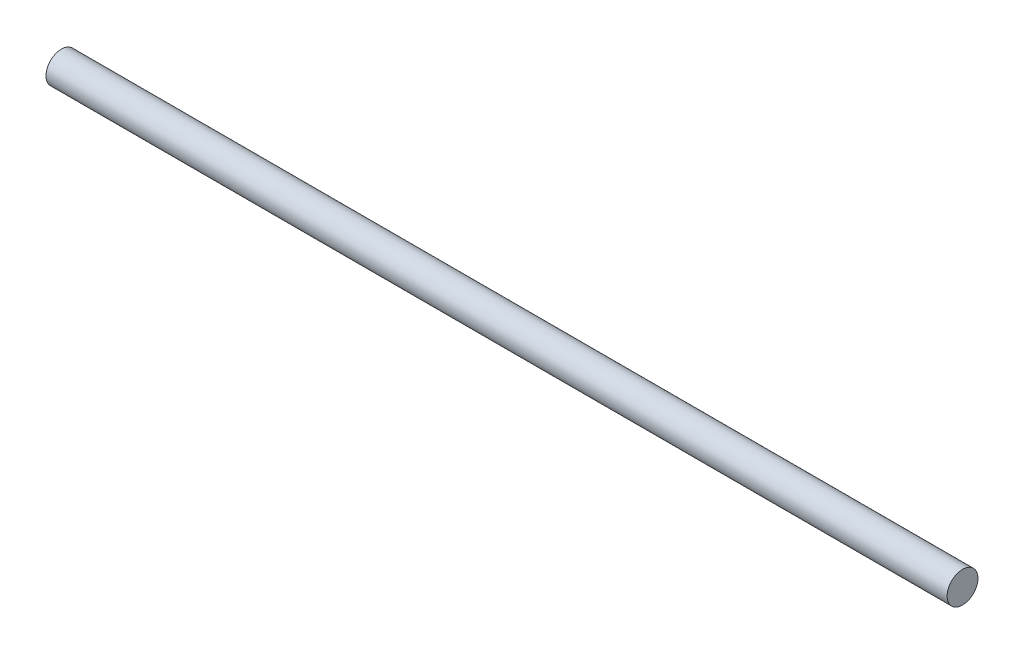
ISO-10303-21;
HEADER;
FILE_DESCRIPTION(('STEP AP214'),'2;1');
FILE_NAME('part.step','',(''),(''),'','','');
FILE_SCHEMA(('AUTOMOTIVE_DESIGN { 1 0 10303 214 1 1 1 1 }'));
ENDSEC;
DATA;
#1=APPLICATION_CONTEXT('core data for automotive mechanical design processes');
#2=APPLICATION_PROTOCOL_DEFINITION('international standard','automotive_design',2000,#1);
#3=PRODUCT_CONTEXT('',#1,'mechanical');
#4=PRODUCT('Part','Part','',(#3));
#5=PRODUCT_RELATED_PRODUCT_CATEGORY('part','',(#4));
#6=PRODUCT_DEFINITION_FORMATION('','',#4);
#7=PRODUCT_DEFINITION_CONTEXT('part definition',#1,'design');
#8=PRODUCT_DEFINITION('design','',#6,#7);
#9=PRODUCT_DEFINITION_SHAPE('','',#8);
#10=(LENGTH_UNIT() NAMED_UNIT(*) SI_UNIT(.MILLI.,.METRE.));
#11=(NAMED_UNIT(*) PLANE_ANGLE_UNIT() SI_UNIT($,.RADIAN.));
#12=(NAMED_UNIT(*) SI_UNIT($,.STERADIAN.) SOLID_ANGLE_UNIT());
#13=UNCERTAINTY_MEASURE_WITH_UNIT(LENGTH_MEASURE(1.E-05),#10,'distance_accuracy_value','');
#14=(GEOMETRIC_REPRESENTATION_CONTEXT(3) GLOBAL_UNCERTAINTY_ASSIGNED_CONTEXT((#13)) GLOBAL_UNIT_ASSIGNED_CONTEXT((#10,
#11,#12)) REPRESENTATION_CONTEXT('',''));
#15=CARTESIAN_POINT('',(0.,0.,0.));
#16=DIRECTION('',(0.,0.,1.));
#17=DIRECTION('',(1.,0.,0.));
#18=AXIS2_PLACEMENT_3D('',#15,#16,#17);
#19=CARTESIAN_POINT('',(175.,0.,0.));
#20=DIRECTION('',(-1.,0.,0.));
#21=DIRECTION('',(0.,0.,1.));
#22=AXIS2_PLACEMENT_3D('',#19,#20,#21);
#23=CYLINDRICAL_SURFACE('',#22,3.);
#24=CARTESIAN_POINT('',(175.,0.,0.));
#25=DIRECTION('',(1.,0.,0.));
#26=DIRECTION('',(0.,0.,-1.));
#27=AXIS2_PLACEMENT_3D('',#24,#25,#26);
#28=CIRCLE('',#27,3.);
#29=CARTESIAN_POINT('',(175.,0.,-3.));
#30=VERTEX_POINT('',#29);
#31=EDGE_CURVE('E10',#30,#30,#28,.T.);
#32=ORIENTED_EDGE('',*,*,#31,.F.);
#33=EDGE_LOOP('',(#32));
#34=FACE_BOUND('',#33,.T.);
#35=CARTESIAN_POINT('',(0.,0.,0.));
#36=DIRECTION('',(1.,0.,0.));
#37=DIRECTION('',(0.,0.,-1.));
#38=AXIS2_PLACEMENT_3D('',#35,#36,#37);
#39=CIRCLE('',#38,3.);
#40=CARTESIAN_POINT('',(0.,0.,-3.));
#41=VERTEX_POINT('',#40);
#42=EDGE_CURVE('E33',#41,#41,#39,.T.);
#43=ORIENTED_EDGE('',*,*,#42,.T.);
#44=EDGE_LOOP('',(#43));
#45=FACE_BOUND('',#44,.T.);
#46=ADVANCED_FACE('F30',(#34,#45),#23,.T.);
#47=CARTESIAN_POINT('',(175.,0.,0.));
#48=DIRECTION('',(1.,0.,0.));
#49=DIRECTION('',(0.,0.,-1.));
#50=AXIS2_PLACEMENT_3D('',#47,#48,#49);
#51=PLANE('',#50);
#52=ORIENTED_EDGE('',*,*,#31,.T.);
#53=EDGE_LOOP('',(#52));
#54=FACE_BOUND('',#53,.T.);
#55=ADVANCED_FACE('F45',(#54),#51,.T.);
#56=CARTESIAN_POINT('',(0.,0.,0.));
#57=DIRECTION('',(1.,0.,0.));
#58=DIRECTION('',(0.,0.,-1.));
#59=AXIS2_PLACEMENT_3D('',#56,#57,#58);
#60=PLANE('',#59);
#61=ORIENTED_EDGE('',*,*,#42,.F.);
#62=EDGE_LOOP('',(#61));
#63=FACE_BOUND('',#62,.T.);
#64=ADVANCED_FACE('F43',(#63),#60,.F.);
#65=CLOSED_SHELL('',(#46,#55,#64));
#66=MANIFOLD_SOLID_BREP('B2',#65);
#67=ADVANCED_BREP_SHAPE_REPRESENTATION('',(#18,#66),#14);
#68=SHAPE_DEFINITION_REPRESENTATION(#9,#67);
ENDSEC;
END-ISO-10303-21;
